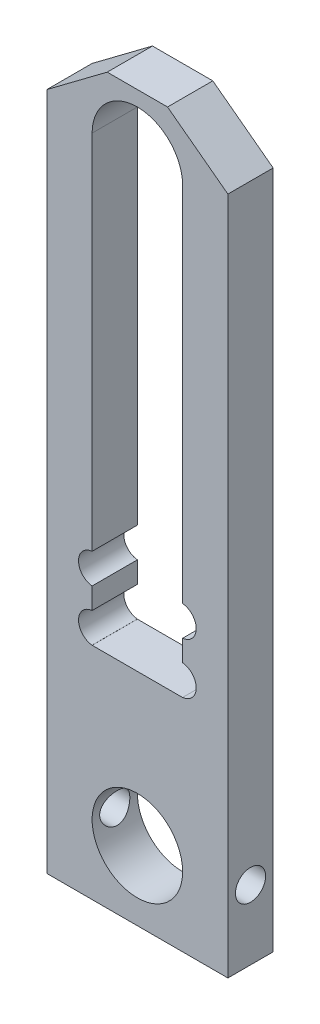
ISO-10303-21;
HEADER;
FILE_DESCRIPTION(('STEP AP214'),'2;1');
FILE_NAME('part.step','',(''),(''),'','','');
FILE_SCHEMA(('AUTOMOTIVE_DESIGN { 1 0 10303 214 1 1 1 1 }'));
ENDSEC;
DATA;
#1=APPLICATION_CONTEXT('core data for automotive mechanical design processes');
#2=APPLICATION_PROTOCOL_DEFINITION('international standard','automotive_design',2000,#1);
#3=PRODUCT_CONTEXT('',#1,'mechanical');
#4=PRODUCT('Part','Part','',(#3));
#5=PRODUCT_RELATED_PRODUCT_CATEGORY('part','',(#4));
#6=PRODUCT_DEFINITION_FORMATION('','',#4);
#7=PRODUCT_DEFINITION_CONTEXT('part definition',#1,'design');
#8=PRODUCT_DEFINITION('design','',#6,#7);
#9=PRODUCT_DEFINITION_SHAPE('','',#8);
#10=(LENGTH_UNIT() NAMED_UNIT(*) SI_UNIT(.MILLI.,.METRE.));
#11=(NAMED_UNIT(*) PLANE_ANGLE_UNIT() SI_UNIT($,.RADIAN.));
#12=(NAMED_UNIT(*) SI_UNIT($,.STERADIAN.) SOLID_ANGLE_UNIT());
#13=UNCERTAINTY_MEASURE_WITH_UNIT(LENGTH_MEASURE(1.E-05),#10,'distance_accuracy_value','');
#14=(GEOMETRIC_REPRESENTATION_CONTEXT(3) GLOBAL_UNCERTAINTY_ASSIGNED_CONTEXT((#13)) GLOBAL_UNIT_ASSIGNED_CONTEXT((#10,
#11,#12)) REPRESENTATION_CONTEXT('',''));
#15=CARTESIAN_POINT('',(0.,0.,0.));
#16=DIRECTION('',(0.,0.,1.));
#17=DIRECTION('',(1.,0.,0.));
#18=AXIS2_PLACEMENT_3D('',#15,#16,#17);
#19=CARTESIAN_POINT('',(30.,-23.,7.5));
#20=DIRECTION('',(0.,0.,1.));
#21=DIRECTION('',(1.,0.,0.));
#22=AXIS2_PLACEMENT_3D('',#19,#20,#21);
#23=PLANE('',#22);
#24=CARTESIAN_POINT('',(0.,0.,7.5));
#25=DIRECTION('',(0.,0.,1.));
#26=DIRECTION('',(1.,0.,0.));
#27=AXIS2_PLACEMENT_3D('',#24,#25,#26);
#28=CIRCLE('',#27,15.);
#29=CARTESIAN_POINT('',(15.,0.,7.5));
#30=VERTEX_POINT('',#29);
#31=EDGE_CURVE('E213',#30,#30,#28,.T.);
#32=ORIENTED_EDGE('',*,*,#31,.F.);
#33=EDGE_LOOP('',(#32));
#34=FACE_BOUND('',#33,.T.);
#35=DIRECTION('',(0.,1.,0.));
#36=VECTOR('',#35,1.);
#37=CARTESIAN_POINT('',(30.,202.,7.5));
#38=LINE('',#37,#36);
#39=CARTESIAN_POINT('',(30.,-23.,7.5));
#40=VERTEX_POINT('',#39);
#41=CARTESIAN_POINT('',(30.,202.,7.5));
#42=VERTEX_POINT('',#41);
#43=EDGE_CURVE('E216',#40,#42,#38,.T.);
#44=ORIENTED_EDGE('',*,*,#43,.T.);
#45=DIRECTION('',(-0.800000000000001,0.599999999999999,0.));
#46=VECTOR('',#45,1.);
#47=CARTESIAN_POINT('',(10.,217.,7.5));
#48=LINE('',#47,#46);
#49=CARTESIAN_POINT('',(10.,217.,7.5));
#50=VERTEX_POINT('',#49);
#51=EDGE_CURVE('E219',#42,#50,#48,.T.);
#52=ORIENTED_EDGE('',*,*,#51,.T.);
#53=DIRECTION('',(-1.,0.,0.));
#54=VECTOR('',#53,1.);
#55=CARTESIAN_POINT('',(10.,217.,7.5));
#56=LINE('',#55,#54);
#57=CARTESIAN_POINT('',(-10.,217.,7.5));
#58=VERTEX_POINT('',#57);
#59=EDGE_CURVE('E221',#50,#58,#56,.T.);
#60=ORIENTED_EDGE('',*,*,#59,.T.);
#61=DIRECTION('',(-0.800000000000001,-0.599999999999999,0.));
#62=VECTOR('',#61,1.);
#63=CARTESIAN_POINT('',(-10.,217.,7.5));
#64=LINE('',#63,#62);
#65=CARTESIAN_POINT('',(-30.,202.,7.5));
#66=VERTEX_POINT('',#65);
#67=EDGE_CURVE('E223',#58,#66,#64,.T.);
#68=ORIENTED_EDGE('',*,*,#67,.T.);
#69=DIRECTION('',(0.,-1.,0.));
#70=VECTOR('',#69,1.);
#71=CARTESIAN_POINT('',(-30.,202.,7.5));
#72=LINE('',#71,#70);
#73=CARTESIAN_POINT('',(-30.,-23.,7.5));
#74=VERTEX_POINT('',#73);
#75=EDGE_CURVE('E225',#66,#74,#72,.T.);
#76=ORIENTED_EDGE('',*,*,#75,.T.);
#77=DIRECTION('',(1.,0.,0.));
#78=VECTOR('',#77,1.);
#79=CARTESIAN_POINT('',(-30.,-23.,7.5));
#80=LINE('',#79,#78);
#81=EDGE_CURVE('E227',#74,#40,#80,.T.);
#82=ORIENTED_EDGE('',*,*,#81,.T.);
#83=EDGE_LOOP('',(#44,#52,#60,#68,#76,#82));
#84=FACE_BOUND('',#83,.T.);
#85=DIRECTION('',(0.,1.,0.));
#86=VECTOR('',#85,1.);
#87=CARTESIAN_POINT('',(15.,50.,7.5));
#88=LINE('',#87,#86);
#89=CARTESIAN_POINT('',(15.,59.9749371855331,7.5));
#90=VERTEX_POINT('',#89);
#91=CARTESIAN_POINT('',(15.,67.0250628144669,7.5));
#92=VERTEX_POINT('',#91);
#93=EDGE_CURVE('E180',#90,#92,#88,.T.);
#94=ORIENTED_EDGE('',*,*,#93,.F.);
#95=CARTESIAN_POINT('',(14.5,55.,7.5));
#96=DIRECTION('',(0.,0.,-1.));
#97=DIRECTION('',(-1.,0.,0.));
#98=AXIS2_PLACEMENT_3D('',#95,#96,#97);
#99=CIRCLE('',#98,5.);
#100=CARTESIAN_POINT('',(15.,50.0250628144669,7.5));
#101=VERTEX_POINT('',#100);
#102=EDGE_CURVE('E166',#90,#101,#99,.T.);
#103=ORIENTED_EDGE('',*,*,#102,.T.);
#104=CARTESIAN_POINT('',(15.,50.,7.5));
#105=VERTEX_POINT('',#104);
#106=EDGE_CURVE('E187',#105,#101,#88,.T.);
#107=ORIENTED_EDGE('',*,*,#106,.F.);
#108=DIRECTION('',(1.,0.,0.));
#109=VECTOR('',#108,1.);
#110=CARTESIAN_POINT('',(-15.,50.,7.5));
#111=LINE('',#110,#109);
#112=CARTESIAN_POINT('',(-15.,50.,7.5));
#113=VERTEX_POINT('',#112);
#114=EDGE_CURVE('E191',#113,#105,#111,.T.);
#115=ORIENTED_EDGE('',*,*,#114,.F.);
#116=DIRECTION('',(0.,-1.,0.));
#117=VECTOR('',#116,1.);
#118=CARTESIAN_POINT('',(-15.,50.,7.5));
#119=LINE('',#118,#117);
#120=CARTESIAN_POINT('',(-15.,50.0250628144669,7.5));
#121=VERTEX_POINT('',#120);
#122=EDGE_CURVE('E197',#121,#113,#119,.T.);
#123=ORIENTED_EDGE('',*,*,#122,.F.);
#124=CARTESIAN_POINT('',(-14.5,55.,7.5));
#125=DIRECTION('',(0.,0.,1.));
#126=DIRECTION('',(1.,0.,0.));
#127=AXIS2_PLACEMENT_3D('',#124,#125,#126);
#128=CIRCLE('',#127,5.);
#129=CARTESIAN_POINT('',(-15.,59.9749371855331,7.5));
#130=VERTEX_POINT('',#129);
#131=EDGE_CURVE('E388',#130,#121,#128,.T.);
#132=ORIENTED_EDGE('',*,*,#131,.F.);
#133=CARTESIAN_POINT('',(-15.,67.0250628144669,7.5));
#134=VERTEX_POINT('',#133);
#135=EDGE_CURVE('E202',#134,#130,#119,.T.);
#136=ORIENTED_EDGE('',*,*,#135,.F.);
#137=CARTESIAN_POINT('',(-14.5,72.,7.5));
#138=DIRECTION('',(0.,0.,1.));
#139=DIRECTION('',(1.,0.,0.));
#140=AXIS2_PLACEMENT_3D('',#137,#138,#139);
#141=CIRCLE('',#140,5.);
#142=CARTESIAN_POINT('',(-15.,76.9749371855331,7.5));
#143=VERTEX_POINT('',#142);
#144=EDGE_CURVE('E379',#143,#134,#141,.T.);
#145=ORIENTED_EDGE('',*,*,#144,.F.);
#146=CARTESIAN_POINT('',(-15.,197.,7.5));
#147=VERTEX_POINT('',#146);
#148=EDGE_CURVE('E198',#147,#143,#119,.T.);
#149=ORIENTED_EDGE('',*,*,#148,.F.);
#150=CARTESIAN_POINT('',(0.,197.,7.5));
#151=DIRECTION('',(0.,0.,1.));
#152=DIRECTION('',(1.,0.,0.));
#153=AXIS2_PLACEMENT_3D('',#150,#151,#152);
#154=CIRCLE('',#153,15.);
#155=CARTESIAN_POINT('',(15.,197.,7.5));
#156=VERTEX_POINT('',#155);
#157=EDGE_CURVE('E190',#156,#147,#154,.T.);
#158=ORIENTED_EDGE('',*,*,#157,.F.);
#159=CARTESIAN_POINT('',(15.,76.9749371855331,7.5));
#160=VERTEX_POINT('',#159);
#161=EDGE_CURVE('E188',#160,#156,#88,.T.);
#162=ORIENTED_EDGE('',*,*,#161,.F.);
#163=CARTESIAN_POINT('',(14.5,72.,7.5));
#164=DIRECTION('',(0.,0.,-1.));
#165=DIRECTION('',(-1.,0.,0.));
#166=AXIS2_PLACEMENT_3D('',#163,#164,#165);
#167=CIRCLE('',#166,5.);
#168=EDGE_CURVE('E186',#160,#92,#167,.T.);
#169=ORIENTED_EDGE('',*,*,#168,.T.);
#170=EDGE_LOOP('',(#94,#103,#107,#115,#123,#132,#136,#145,#149,#158,#162,#169));
#171=FACE_BOUND('',#170,.T.);
#172=ADVANCED_FACE('F37',(#34,#84,#171),#23,.T.);
#173=CARTESIAN_POINT('',(15.,50.,7.5));
#174=DIRECTION('',(-1.,0.,0.));
#175=DIRECTION('',(0.,0.,1.));
#176=AXIS2_PLACEMENT_3D('',#173,#174,#175);
#177=PLANE('',#176);
#178=ORIENTED_EDGE('',*,*,#106,.T.);
#179=DIRECTION('',(0.,0.,1.));
#180=VECTOR('',#179,1.);
#181=CARTESIAN_POINT('',(15.,50.0250628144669,-7.5));
#182=LINE('',#181,#180);
#183=CARTESIAN_POINT('',(15.,50.0250628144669,-7.5));
#184=VERTEX_POINT('',#183);
#185=EDGE_CURVE('E169',#101,#184,#182,.F.);
#186=ORIENTED_EDGE('',*,*,#185,.T.);
#187=DIRECTION('',(0.,1.,0.));
#188=VECTOR('',#187,1.);
#189=CARTESIAN_POINT('',(15.,50.,-7.5));
#190=LINE('',#189,#188);
#191=CARTESIAN_POINT('',(15.,50.,-7.5));
#192=VERTEX_POINT('',#191);
#193=EDGE_CURVE('E361',#192,#184,#190,.T.);
#194=ORIENTED_EDGE('',*,*,#193,.F.);
#195=DIRECTION('',(0.,0.,-1.));
#196=VECTOR('',#195,1.);
#197=CARTESIAN_POINT('',(15.,50.,7.5));
#198=LINE('',#197,#196);
#199=EDGE_CURVE('E210',#105,#192,#198,.T.);
#200=ORIENTED_EDGE('',*,*,#199,.F.);
#201=EDGE_LOOP('',(#178,#186,#194,#200));
#202=FACE_BOUND('',#201,.T.);
#203=ADVANCED_FACE('F282',(#202),#177,.T.);
#204=CARTESIAN_POINT('',(15.,59.9749371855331,-7.5));
#205=VERTEX_POINT('',#204);
#206=CARTESIAN_POINT('',(15.,67.0250628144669,-7.5));
#207=VERTEX_POINT('',#206);
#208=EDGE_CURVE('E182',#205,#207,#190,.T.);
#209=ORIENTED_EDGE('',*,*,#208,.F.);
#210=DIRECTION('',(0.,0.,1.));
#211=VECTOR('',#210,1.);
#212=CARTESIAN_POINT('',(15.,59.9749371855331,-7.5));
#213=LINE('',#212,#211);
#214=EDGE_CURVE('E58',#205,#90,#213,.T.);
#215=ORIENTED_EDGE('',*,*,#214,.T.);
#216=ORIENTED_EDGE('',*,*,#93,.T.);
#217=DIRECTION('',(0.,0.,1.));
#218=VECTOR('',#217,1.);
#219=CARTESIAN_POINT('',(15.,67.0250628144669,-7.5));
#220=LINE('',#219,#218);
#221=EDGE_CURVE('E390',#92,#207,#220,.F.);
#222=ORIENTED_EDGE('',*,*,#221,.T.);
#223=EDGE_LOOP('',(#209,#215,#216,#222));
#224=FACE_BOUND('',#223,.T.);
#225=ADVANCED_FACE('F178',(#224),#177,.T.);
#226=CARTESIAN_POINT('',(30.,-23.,-7.5));
#227=DIRECTION('',(0.,0.,1.));
#228=DIRECTION('',(1.,0.,0.));
#229=AXIS2_PLACEMENT_3D('',#226,#227,#228);
#230=PLANE('',#229);
#231=CARTESIAN_POINT('',(0.,0.,-7.5));
#232=DIRECTION('',(0.,0.,1.));
#233=DIRECTION('',(1.,0.,0.));
#234=AXIS2_PLACEMENT_3D('',#231,#232,#233);
#235=CIRCLE('',#234,15.);
#236=CARTESIAN_POINT('',(15.,0.,-7.5));
#237=VERTEX_POINT('',#236);
#238=EDGE_CURVE('E340',#237,#237,#235,.T.);
#239=ORIENTED_EDGE('',*,*,#238,.T.);
#240=EDGE_LOOP('',(#239));
#241=FACE_BOUND('',#240,.T.);
#242=DIRECTION('',(0.,1.,0.));
#243=VECTOR('',#242,1.);
#244=CARTESIAN_POINT('',(30.,202.,-7.5));
#245=LINE('',#244,#243);
#246=CARTESIAN_POINT('',(30.,-23.,-7.5));
#247=VERTEX_POINT('',#246);
#248=CARTESIAN_POINT('',(30.,202.,-7.5));
#249=VERTEX_POINT('',#248);
#250=EDGE_CURVE('E333',#247,#249,#245,.T.);
#251=ORIENTED_EDGE('',*,*,#250,.F.);
#252=DIRECTION('',(1.,0.,0.));
#253=VECTOR('',#252,1.);
#254=CARTESIAN_POINT('',(-30.,-23.,-7.5));
#255=LINE('',#254,#253);
#256=CARTESIAN_POINT('',(-30.,-23.,-7.5));
#257=VERTEX_POINT('',#256);
#258=EDGE_CURVE('E353',#257,#247,#255,.T.);
#259=ORIENTED_EDGE('',*,*,#258,.F.);
#260=DIRECTION('',(0.,-1.,0.));
#261=VECTOR('',#260,1.);
#262=CARTESIAN_POINT('',(-30.,202.,-7.5));
#263=LINE('',#262,#261);
#264=CARTESIAN_POINT('',(-30.,202.,-7.5));
#265=VERTEX_POINT('',#264);
#266=EDGE_CURVE('E351',#265,#257,#263,.T.);
#267=ORIENTED_EDGE('',*,*,#266,.F.);
#268=DIRECTION('',(-0.800000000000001,-0.599999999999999,0.));
#269=VECTOR('',#268,1.);
#270=CARTESIAN_POINT('',(-10.,217.,-7.5));
#271=LINE('',#270,#269);
#272=CARTESIAN_POINT('',(-10.,217.,-7.5));
#273=VERTEX_POINT('',#272);
#274=EDGE_CURVE('E348',#273,#265,#271,.T.);
#275=ORIENTED_EDGE('',*,*,#274,.F.);
#276=DIRECTION('',(-1.,0.,0.));
#277=VECTOR('',#276,1.);
#278=CARTESIAN_POINT('',(10.,217.,-7.5));
#279=LINE('',#278,#277);
#280=CARTESIAN_POINT('',(10.,217.,-7.5));
#281=VERTEX_POINT('',#280);
#282=EDGE_CURVE('E337',#281,#273,#279,.T.);
#283=ORIENTED_EDGE('',*,*,#282,.F.);
#284=DIRECTION('',(-0.800000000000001,0.599999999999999,0.));
#285=VECTOR('',#284,1.);
#286=CARTESIAN_POINT('',(10.,217.,-7.5));
#287=LINE('',#286,#285);
#288=EDGE_CURVE('E324',#249,#281,#287,.T.);
#289=ORIENTED_EDGE('',*,*,#288,.F.);
#290=EDGE_LOOP('',(#251,#259,#267,#275,#283,#289));
#291=FACE_BOUND('',#290,.T.);
#292=CARTESIAN_POINT('',(14.5,55.,-7.5));
#293=DIRECTION('',(0.,0.,-1.));
#294=DIRECTION('',(-1.,0.,0.));
#295=AXIS2_PLACEMENT_3D('',#292,#293,#294);
#296=CIRCLE('',#295,5.);
#297=EDGE_CURVE('E174',#205,#184,#296,.T.);
#298=ORIENTED_EDGE('',*,*,#297,.F.);
#299=ORIENTED_EDGE('',*,*,#208,.T.);
#300=CARTESIAN_POINT('',(14.5,72.,-7.5));
#301=DIRECTION('',(0.,0.,-1.));
#302=DIRECTION('',(-1.,0.,0.));
#303=AXIS2_PLACEMENT_3D('',#300,#301,#302);
#304=CIRCLE('',#303,5.);
#305=CARTESIAN_POINT('',(15.,76.9749371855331,-7.5));
#306=VERTEX_POINT('',#305);
#307=EDGE_CURVE('E393',#306,#207,#304,.T.);
#308=ORIENTED_EDGE('',*,*,#307,.F.);
#309=CARTESIAN_POINT('',(15.,197.,-7.5));
#310=VERTEX_POINT('',#309);
#311=EDGE_CURVE('E364',#306,#310,#190,.T.);
#312=ORIENTED_EDGE('',*,*,#311,.T.);
#313=CARTESIAN_POINT('',(0.,197.,-7.5));
#314=DIRECTION('',(0.,0.,1.));
#315=DIRECTION('',(1.,0.,0.));
#316=AXIS2_PLACEMENT_3D('',#313,#314,#315);
#317=CIRCLE('',#316,15.);
#318=CARTESIAN_POINT('',(-15.,197.,-7.5));
#319=VERTEX_POINT('',#318);
#320=EDGE_CURVE('E362',#310,#319,#317,.T.);
#321=ORIENTED_EDGE('',*,*,#320,.T.);
#322=DIRECTION('',(0.,-1.,0.));
#323=VECTOR('',#322,1.);
#324=CARTESIAN_POINT('',(-15.,50.,-7.5));
#325=LINE('',#324,#323);
#326=CARTESIAN_POINT('',(-15.,76.9749371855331,-7.5));
#327=VERTEX_POINT('',#326);
#328=EDGE_CURVE('E343',#319,#327,#325,.T.);
#329=ORIENTED_EDGE('',*,*,#328,.T.);
#330=CARTESIAN_POINT('',(-14.5,72.,-7.5));
#331=DIRECTION('',(0.,0.,1.));
#332=DIRECTION('',(1.,0.,0.));
#333=AXIS2_PLACEMENT_3D('',#330,#331,#332);
#334=CIRCLE('',#333,5.);
#335=CARTESIAN_POINT('',(-15.,67.0250628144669,-7.5));
#336=VERTEX_POINT('',#335);
#337=EDGE_CURVE('E376',#327,#336,#334,.T.);
#338=ORIENTED_EDGE('',*,*,#337,.T.);
#339=CARTESIAN_POINT('',(-15.,59.9749371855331,-7.5));
#340=VERTEX_POINT('',#339);
#341=EDGE_CURVE('E561',#336,#340,#325,.T.);
#342=ORIENTED_EDGE('',*,*,#341,.T.);
#343=CARTESIAN_POINT('',(-14.5,55.,-7.5));
#344=DIRECTION('',(0.,0.,1.));
#345=DIRECTION('',(1.,0.,0.));
#346=AXIS2_PLACEMENT_3D('',#343,#344,#345);
#347=CIRCLE('',#346,5.);
#348=CARTESIAN_POINT('',(-15.,50.0250628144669,-7.5));
#349=VERTEX_POINT('',#348);
#350=EDGE_CURVE('E385',#340,#349,#347,.T.);
#351=ORIENTED_EDGE('',*,*,#350,.T.);
#352=CARTESIAN_POINT('',(-15.,50.,-7.5));
#353=VERTEX_POINT('',#352);
#354=EDGE_CURVE('E366',#349,#353,#325,.T.);
#355=ORIENTED_EDGE('',*,*,#354,.T.);
#356=DIRECTION('',(1.,0.,0.));
#357=VECTOR('',#356,1.);
#358=CARTESIAN_POINT('',(-15.,50.,-7.5));
#359=LINE('',#358,#357);
#360=EDGE_CURVE('E369',#353,#192,#359,.T.);
#361=ORIENTED_EDGE('',*,*,#360,.T.);
#362=ORIENTED_EDGE('',*,*,#193,.T.);
#363=EDGE_LOOP('',(#298,#299,#308,#312,#321,#329,#338,#342,#351,#355,#361,#362));
#364=FACE_BOUND('',#363,.T.);
#365=ADVANCED_FACE('F267',(#241,#291,#364),#230,.F.);
#366=ORIENTED_EDGE('',*,*,#311,.F.);
#367=DIRECTION('',(0.,0.,1.));
#368=VECTOR('',#367,1.);
#369=CARTESIAN_POINT('',(15.,76.9749371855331,-7.5));
#370=LINE('',#369,#368);
#371=EDGE_CURVE('E66',#306,#160,#370,.T.);
#372=ORIENTED_EDGE('',*,*,#371,.T.);
#373=ORIENTED_EDGE('',*,*,#161,.T.);
#374=DIRECTION('',(0.,0.,-1.));
#375=VECTOR('',#374,1.);
#376=CARTESIAN_POINT('',(15.,197.,7.5));
#377=LINE('',#376,#375);
#378=EDGE_CURVE('E207',#156,#310,#377,.T.);
#379=ORIENTED_EDGE('',*,*,#378,.T.);
#380=EDGE_LOOP('',(#366,#372,#373,#379));
#381=FACE_BOUND('',#380,.T.);
#382=ADVANCED_FACE('F270',(#381),#177,.T.);
#383=CARTESIAN_POINT('',(-15.,50.,7.5));
#384=DIRECTION('',(1.,0.,0.));
#385=DIRECTION('',(0.,0.,-1.));
#386=AXIS2_PLACEMENT_3D('',#383,#384,#385);
#387=PLANE('',#386);
#388=DIRECTION('',(0.,0.,1.));
#389=VECTOR('',#388,1.);
#390=CARTESIAN_POINT('',(-15.,59.9749371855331,-7.5));
#391=LINE('',#390,#389);
#392=EDGE_CURVE('E381',#340,#130,#391,.T.);
#393=ORIENTED_EDGE('',*,*,#392,.F.);
#394=ORIENTED_EDGE('',*,*,#341,.F.);
#395=DIRECTION('',(0.,0.,1.));
#396=VECTOR('',#395,1.);
#397=CARTESIAN_POINT('',(-15.,67.0250628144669,-7.5));
#398=LINE('',#397,#396);
#399=EDGE_CURVE('E372',#134,#336,#398,.F.);
#400=ORIENTED_EDGE('',*,*,#399,.F.);
#401=ORIENTED_EDGE('',*,*,#135,.T.);
#402=EDGE_LOOP('',(#393,#394,#400,#401));
#403=FACE_BOUND('',#402,.T.);
#404=ADVANCED_FACE('F276',(#403),#387,.T.);
#405=DIRECTION('',(0.,0.,1.));
#406=VECTOR('',#405,1.);
#407=CARTESIAN_POINT('',(-15.,76.9749371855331,-7.5));
#408=LINE('',#407,#406);
#409=EDGE_CURVE('E371',#327,#143,#408,.T.);
#410=ORIENTED_EDGE('',*,*,#409,.F.);
#411=ORIENTED_EDGE('',*,*,#328,.F.);
#412=DIRECTION('',(0.,0.,-1.));
#413=VECTOR('',#412,1.);
#414=CARTESIAN_POINT('',(-15.,197.,7.5));
#415=LINE('',#414,#413);
#416=EDGE_CURVE('E205',#147,#319,#415,.T.);
#417=ORIENTED_EDGE('',*,*,#416,.F.);
#418=ORIENTED_EDGE('',*,*,#148,.T.);
#419=EDGE_LOOP('',(#410,#411,#417,#418));
#420=FACE_BOUND('',#419,.T.);
#421=ADVANCED_FACE('F277',(#420),#387,.T.);
#422=CARTESIAN_POINT('',(30.,202.,7.5));
#423=DIRECTION('',(-1.,0.,0.));
#424=DIRECTION('',(0.,-1.,0.));
#425=AXIS2_PLACEMENT_3D('',#422,#423,#424);
#426=PLANE('',#425);
#427=CARTESIAN_POINT('',(30.,0.,0.));
#428=DIRECTION('',(1.,0.,0.));
#429=DIRECTION('',(0.,1.,0.));
#430=AXIS2_PLACEMENT_3D('',#427,#428,#429);
#431=CIRCLE('',#430,5.);
#432=CARTESIAN_POINT('',(30.,4.99999999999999,0.));
#433=VERTEX_POINT('',#432);
#434=EDGE_CURVE('E400',#433,#433,#431,.T.);
#435=ORIENTED_EDGE('',*,*,#434,.F.);
#436=EDGE_LOOP('',(#435));
#437=FACE_BOUND('',#436,.T.);
#438=DIRECTION('',(0.,0.,-1.));
#439=VECTOR('',#438,1.);
#440=CARTESIAN_POINT('',(30.,-23.,7.5));
#441=LINE('',#440,#439);
#442=EDGE_CURVE('E229',#40,#247,#441,.T.);
#443=ORIENTED_EDGE('',*,*,#442,.T.);
#444=ORIENTED_EDGE('',*,*,#250,.T.);
#445=DIRECTION('',(0.,0.,-1.));
#446=VECTOR('',#445,1.);
#447=CARTESIAN_POINT('',(30.,202.,7.5));
#448=LINE('',#447,#446);
#449=EDGE_CURVE('E11',#42,#249,#448,.T.);
#450=ORIENTED_EDGE('',*,*,#449,.F.);
#451=ORIENTED_EDGE('',*,*,#43,.F.);
#452=EDGE_LOOP('',(#443,#444,#450,#451));
#453=FACE_BOUND('',#452,.T.);
#454=ADVANCED_FACE('F39',(#437,#453),#426,.F.);
#455=CARTESIAN_POINT('',(10.,217.,7.5));
#456=DIRECTION('',(-0.599999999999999,-0.800000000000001,0.));
#457=DIRECTION('',(0.800000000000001,-0.599999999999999,0.));
#458=AXIS2_PLACEMENT_3D('',#455,#456,#457);
#459=PLANE('',#458);
#460=ORIENTED_EDGE('',*,*,#449,.T.);
#461=ORIENTED_EDGE('',*,*,#288,.T.);
#462=DIRECTION('',(0.,0.,-1.));
#463=VECTOR('',#462,1.);
#464=CARTESIAN_POINT('',(10.,217.,7.5));
#465=LINE('',#464,#463);
#466=EDGE_CURVE('E50',#50,#281,#465,.T.);
#467=ORIENTED_EDGE('',*,*,#466,.F.);
#468=ORIENTED_EDGE('',*,*,#51,.F.);
#469=EDGE_LOOP('',(#460,#461,#467,#468));
#470=FACE_BOUND('',#469,.T.);
#471=ADVANCED_FACE('F312',(#470),#459,.F.);
#472=CARTESIAN_POINT('',(10.,217.,7.5));
#473=DIRECTION('',(0.,-1.,0.));
#474=DIRECTION('',(0.,0.,-1.));
#475=AXIS2_PLACEMENT_3D('',#472,#473,#474);
#476=PLANE('',#475);
#477=ORIENTED_EDGE('',*,*,#466,.T.);
#478=ORIENTED_EDGE('',*,*,#282,.T.);
#479=DIRECTION('',(0.,0.,-1.));
#480=VECTOR('',#479,1.);
#481=CARTESIAN_POINT('',(-10.,217.,7.5));
#482=LINE('',#481,#480);
#483=EDGE_CURVE('E235',#58,#273,#482,.T.);
#484=ORIENTED_EDGE('',*,*,#483,.F.);
#485=ORIENTED_EDGE('',*,*,#59,.F.);
#486=EDGE_LOOP('',(#477,#478,#484,#485));
#487=FACE_BOUND('',#486,.T.);
#488=ADVANCED_FACE('F309',(#487),#476,.F.);
#489=CARTESIAN_POINT('',(-10.,217.,7.5));
#490=DIRECTION('',(0.599999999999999,-0.800000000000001,0.));
#491=DIRECTION('',(0.800000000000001,0.599999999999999,0.));
#492=AXIS2_PLACEMENT_3D('',#489,#490,#491);
#493=PLANE('',#492);
#494=ORIENTED_EDGE('',*,*,#483,.T.);
#495=ORIENTED_EDGE('',*,*,#274,.T.);
#496=DIRECTION('',(0.,0.,-1.));
#497=VECTOR('',#496,1.);
#498=CARTESIAN_POINT('',(-30.,202.,7.5));
#499=LINE('',#498,#497);
#500=EDGE_CURVE('E233',#66,#265,#499,.T.);
#501=ORIENTED_EDGE('',*,*,#500,.F.);
#502=ORIENTED_EDGE('',*,*,#67,.F.);
#503=EDGE_LOOP('',(#494,#495,#501,#502));
#504=FACE_BOUND('',#503,.T.);
#505=ADVANCED_FACE('F305',(#504),#493,.F.);
#506=CARTESIAN_POINT('',(-30.,202.,7.5));
#507=DIRECTION('',(1.,0.,0.));
#508=DIRECTION('',(0.,1.,0.));
#509=AXIS2_PLACEMENT_3D('',#506,#507,#508);
#510=PLANE('',#509);
#511=CARTESIAN_POINT('',(-30.0000000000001,0.,0.));
#512=DIRECTION('',(1.,0.,0.));
#513=DIRECTION('',(0.,1.,0.));
#514=AXIS2_PLACEMENT_3D('',#511,#512,#513);
#515=CIRCLE('',#514,5.);
#516=CARTESIAN_POINT('',(-30.0000000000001,5.00000000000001,0.));
#517=VERTEX_POINT('',#516);
#518=EDGE_CURVE('E241',#517,#517,#515,.T.);
#519=ORIENTED_EDGE('',*,*,#518,.T.);
#520=EDGE_LOOP('',(#519));
#521=FACE_BOUND('',#520,.T.);
#522=ORIENTED_EDGE('',*,*,#500,.T.);
#523=ORIENTED_EDGE('',*,*,#266,.T.);
#524=DIRECTION('',(0.,0.,-1.));
#525=VECTOR('',#524,1.);
#526=CARTESIAN_POINT('',(-30.,-23.,7.5));
#527=LINE('',#526,#525);
#528=EDGE_CURVE('E231',#74,#257,#527,.T.);
#529=ORIENTED_EDGE('',*,*,#528,.F.);
#530=ORIENTED_EDGE('',*,*,#75,.F.);
#531=EDGE_LOOP('',(#522,#523,#529,#530));
#532=FACE_BOUND('',#531,.T.);
#533=ADVANCED_FACE('F301',(#521,#532),#510,.F.);
#534=CARTESIAN_POINT('',(-30.,-23.,7.5));
#535=DIRECTION('',(0.,1.,0.));
#536=DIRECTION('',(0.,0.,1.));
#537=AXIS2_PLACEMENT_3D('',#534,#535,#536);
#538=PLANE('',#537);
#539=ORIENTED_EDGE('',*,*,#528,.T.);
#540=ORIENTED_EDGE('',*,*,#258,.T.);
#541=ORIENTED_EDGE('',*,*,#442,.F.);
#542=ORIENTED_EDGE('',*,*,#81,.F.);
#543=EDGE_LOOP('',(#539,#540,#541,#542));
#544=FACE_BOUND('',#543,.T.);
#545=ADVANCED_FACE('F290',(#544),#538,.F.);
#546=CARTESIAN_POINT('',(0.,0.,7.5));
#547=DIRECTION('',(0.,0.,-1.));
#548=DIRECTION('',(-1.,0.,0.));
#549=AXIS2_PLACEMENT_3D('',#546,#547,#548);
#550=CYLINDRICAL_SURFACE('',#549,15.);
#551=CARTESIAN_POINT('',(-15.,0.,5.));
#552=CARTESIAN_POINT('',(-15.0000007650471,-0.272816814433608,5.00000126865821));
#553=CARTESIAN_POINT('',(-14.9924884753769,-0.545625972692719,4.97759866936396));
#554=CARTESIAN_POINT('',(-14.9632605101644,-1.08320880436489,4.88885445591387));
#555=CARTESIAN_POINT('',(-14.941543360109,-1.3479816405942,4.82250828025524));
#556=CARTESIAN_POINT('',(-14.8862653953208,-1.86166394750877,4.64840378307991));
#557=CARTESIAN_POINT('',(-14.8527243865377,-2.11059912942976,4.5407146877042));
#558=CARTESIAN_POINT('',(-14.7772222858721,-2.58687468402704,4.2872941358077));
#559=CARTESIAN_POINT('',(-14.7352595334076,-2.81421078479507,4.1415551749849));
#560=CARTESIAN_POINT('',(-14.6457047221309,-3.24870837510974,3.81087097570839));
#561=CARTESIAN_POINT('',(-14.5979778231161,-3.45501850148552,3.62484382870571));
#562=CARTESIAN_POINT('',(-14.5030157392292,-3.83416346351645,3.22116422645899));
#563=CARTESIAN_POINT('',(-14.4557806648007,-4.00699092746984,3.00350482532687));
#564=CARTESIAN_POINT('',(-14.3656666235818,-4.31912471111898,2.53507442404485));
#565=CARTESIAN_POINT('',(-14.3229519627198,-4.45732429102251,2.28353130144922));
#566=CARTESIAN_POINT('',(-14.2487652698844,-4.68909436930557,1.75911952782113));
#567=CARTESIAN_POINT('',(-14.2172898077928,-4.78267848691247,1.48625741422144));
#568=CARTESIAN_POINT('',(-14.1705651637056,-4.91936730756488,0.936633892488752));
#569=CARTESIAN_POINT('',(-14.1548047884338,-4.96406724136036,0.660313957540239));
#570=CARTESIAN_POINT('',(-14.1397828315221,-5.00670561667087,0.103681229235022));
#571=CARTESIAN_POINT('',(-14.1405161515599,-5.00465850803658,-0.176630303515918));
#572=CARTESIAN_POINT('',(-14.1579507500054,-4.95509951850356,-0.71968315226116));
#573=CARTESIAN_POINT('',(-14.1739207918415,-4.90966956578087,-0.98264201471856));
#574=CARTESIAN_POINT('',(-14.2188328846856,-4.77803081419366,-1.49696709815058));
#575=CARTESIAN_POINT('',(-14.2477764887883,-4.69181713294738,-1.74833192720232));
#576=CARTESIAN_POINT('',(-14.3158955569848,-4.47969529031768,-2.2370637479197));
#577=CARTESIAN_POINT('',(-14.3552282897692,-4.35317024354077,-2.47414012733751));
#578=CARTESIAN_POINT('',(-14.4396279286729,-4.06444553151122,-2.92435454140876));
#579=CARTESIAN_POINT('',(-14.4846964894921,-3.9022355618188,-3.13748563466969));
#580=CARTESIAN_POINT('',(-14.5783664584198,-3.53674666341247,-3.54545799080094));
#581=CARTESIAN_POINT('',(-14.6270294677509,-3.3317657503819,-3.73876347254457));
#582=CARTESIAN_POINT('',(-14.7203469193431,-2.89169784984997,-4.08865633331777));
#583=CARTESIAN_POINT('',(-14.765000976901,-2.65660797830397,-4.24524019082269));
#584=CARTESIAN_POINT('',(-14.8458553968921,-2.15973806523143,-4.51848150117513));
#585=CARTESIAN_POINT('',(-14.8819675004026,-1.8977163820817,-4.6347274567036));
#586=CARTESIAN_POINT('',(-14.9410283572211,-1.35634541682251,-4.82101586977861));
#587=CARTESIAN_POINT('',(-14.9639816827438,-1.07700219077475,-4.8910743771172));
#588=CARTESIAN_POINT('',(-14.9933813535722,-0.521919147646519,-4.98027833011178));
#589=CARTESIAN_POINT('',(-15.0005000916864,-0.246547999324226,-5.00149904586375));
#590=CARTESIAN_POINT('',(-14.9994451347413,0.303875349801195,-4.99833663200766));
#591=CARTESIAN_POINT('',(-14.9912740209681,0.578927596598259,-4.97396120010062));
#592=CARTESIAN_POINT('',(-14.9610012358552,1.11259933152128,-4.8819404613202));
#593=CARTESIAN_POINT('',(-14.9393099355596,1.37146403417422,-4.81556896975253));
#594=CARTESIAN_POINT('',(-14.8845923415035,1.87427979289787,-4.64303277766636));
#595=CARTESIAN_POINT('',(-14.8515646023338,2.11822894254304,-4.53686300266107));
#596=CARTESIAN_POINT('',(-14.7764465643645,2.59144148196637,-4.28464784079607));
#597=CARTESIAN_POINT('',(-14.7341407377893,2.82014979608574,-4.13762703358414));
#598=CARTESIAN_POINT('',(-14.6452626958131,3.25032415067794,-3.80902924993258));
#599=CARTESIAN_POINT('',(-14.5986891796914,3.45178183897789,-3.62744171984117));
#600=CARTESIAN_POINT('',(-14.5038423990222,3.8312625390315,-3.22510624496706));
#601=CARTESIAN_POINT('',(-14.4555880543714,4.00780484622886,-3.00295386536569));
#602=CARTESIAN_POINT('',(-14.3649986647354,4.32128761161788,-2.53114216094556));
#603=CARTESIAN_POINT('',(-14.3226636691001,4.45822773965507,-2.28148260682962));
#604=CARTESIAN_POINT('',(-14.2491195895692,4.68798465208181,-1.76163492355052));
#605=CARTESIAN_POINT('',(-14.2178880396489,4.78089066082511,-1.49148960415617));
#606=CARTESIAN_POINT('',(-14.1705416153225,4.91947333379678,-0.938106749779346));
#607=CARTESIAN_POINT('',(-14.154419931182,4.9651712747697,-0.65487517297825));
#608=CARTESIAN_POINT('',(-14.1398929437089,5.00638141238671,-0.0990145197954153));
#609=CARTESIAN_POINT('',(-14.1406200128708,5.004351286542,0.17341170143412));
#610=CARTESIAN_POINT('',(-14.1575634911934,4.95621146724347,0.713825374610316));
#611=CARTESIAN_POINT('',(-14.1737789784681,4.91010439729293,0.981813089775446));
#612=CARTESIAN_POINT('',(-14.2192262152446,4.77685906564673,1.50067831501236));
#613=CARTESIAN_POINT('',(-14.2482049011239,4.69051673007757,1.75178412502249));
#614=CARTESIAN_POINT('',(-14.3158199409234,4.47989682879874,2.23613703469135));
#615=CARTESIAN_POINT('',(-14.3544584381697,4.35561084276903,2.46938015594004));
#616=CARTESIAN_POINT('',(-14.4391414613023,4.06630346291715,2.92241834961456));
#617=CARTESIAN_POINT('',(-14.4854355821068,3.89974121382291,3.14118250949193));
#618=CARTESIAN_POINT('',(-14.5791678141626,3.53321441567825,3.548449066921));
#619=CARTESIAN_POINT('',(-14.6266062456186,3.33324042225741,3.73694287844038));
#620=CARTESIAN_POINT('',(-14.7195015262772,2.89620778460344,4.08572206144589));
#621=CARTESIAN_POINT('',(-14.7648090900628,2.65800756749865,4.244621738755));
#622=CARTESIAN_POINT('',(-14.8462995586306,2.15678678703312,4.51995214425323));
#623=CARTESIAN_POINT('',(-14.8824847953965,1.89377259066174,4.63639372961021));
#624=CARTESIAN_POINT('',(-14.9402757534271,1.36246823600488,4.81860816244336));
#625=CARTESIAN_POINT('',(-14.9624606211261,1.09493878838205,4.88641233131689));
#626=CARTESIAN_POINT('',(-14.9923203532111,0.551602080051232,4.97710140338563));
#627=CARTESIAN_POINT('',(-14.9999992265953,0.275797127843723,4.99999871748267));
#628=CARTESIAN_POINT('',(-15.,0.,5.));
#629=B_SPLINE_CURVE_WITH_KNOTS('',3,(#551,#552,#553,#554,#555,#556,#557,#558,#559,#560,#561,
#562,#563,#564,#565,#566,#567,#568,#569,#570,#571,#572,#573,#574,#575,#576,#577,#578,#579,#580,
#581,#582,#583,#584,#585,#586,#587,#588,#589,#590,#591,#592,#593,#594,#595,#596,#597,#598,#599,
#600,#601,#602,#603,#604,#605,#606,#607,#608,#609,#610,#611,#612,#613,#614,#615,#616,#617,#618,
#619,#620,#621,#622,#623,#624,#625,#626,#627,#628),.UNSPECIFIED.,.T.,.F.,(4,2,2,2,2,2,2,2,2,2,2,
2,2,2,2,2,2,2,2,2,2,2,2,2,2,2,2,2,2,2,2,2,2,2,2,2,2,2,4),(0.,0.817435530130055,1.6349559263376,
2.45111336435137,3.2674318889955,4.1092342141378,4.95122166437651,5.81741924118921,
6.6833522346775,7.52009628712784,8.3565816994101,9.15484132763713,9.95319654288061,
10.764408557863,11.5758551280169,12.4296652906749,13.2835572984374,14.1459202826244,
15.0079834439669,15.832679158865,16.6572356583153,17.4579078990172,18.2586822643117,
19.0805199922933,19.9026090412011,20.7620511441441,21.6215004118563,22.479200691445,
23.3365142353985,24.1497833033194,24.9630039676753,25.7607793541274,26.5587319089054,
27.3915033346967,28.2245105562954,29.0899830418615,29.9552340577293,30.7818279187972,
31.6081933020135),.UNSPECIFIED.);
#630=CARTESIAN_POINT('',(-15.,0.,5.));
#631=VERTEX_POINT('',#630);
#632=EDGE_CURVE('E41',#631,#631,#629,.T.);
#633=ORIENTED_EDGE('',*,*,#632,.F.);
#634=EDGE_LOOP('',(#633));
#635=FACE_BOUND('',#634,.T.);
#636=CARTESIAN_POINT('',(14.142135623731,5.,0.));
#637=CARTESIAN_POINT('',(14.1421347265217,5.00000128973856,-0.27234087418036));
#638=CARTESIAN_POINT('',(14.1500884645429,4.97767391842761,-0.544673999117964));
#639=CARTESIAN_POINT('',(14.1808787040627,4.88925565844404,-1.08127210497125));
#640=CARTESIAN_POINT('',(14.2037176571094,4.82315756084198,-1.34553574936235));
#641=CARTESIAN_POINT('',(14.2614101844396,4.64977742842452,-1.85813446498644));
#642=CARTESIAN_POINT('',(14.2962401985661,4.54257610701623,-2.10649964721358));
#643=CARTESIAN_POINT('',(14.3739561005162,4.2903081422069,-2.58180024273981));
#644=CARTESIAN_POINT('',(14.4168437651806,4.14523314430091,-2.80873091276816));
#645=CARTESIAN_POINT('',(14.5077244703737,3.81525573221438,-3.24359981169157));
#646=CARTESIAN_POINT('',(14.5558447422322,3.62912170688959,-3.45057714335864));
#647=CARTESIAN_POINT('',(14.6506932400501,3.22493833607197,-3.8310340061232));
#648=CARTESIAN_POINT('',(14.6974212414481,3.00688387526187,-4.00450815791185));
#649=CARTESIAN_POINT('',(14.7856933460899,2.53802253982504,-4.31739448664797));
#650=CARTESIAN_POINT('',(14.8270703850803,2.28650955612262,-4.45579985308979));
#651=CARTESIAN_POINT('',(14.8984793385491,1.76215611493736,-4.68795792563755));
#652=CARTESIAN_POINT('',(14.9285143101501,1.48932142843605,-4.78172266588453));
#653=CARTESIAN_POINT('',(14.9729537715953,0.940144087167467,-4.91867927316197));
#654=CARTESIAN_POINT('',(14.987865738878,0.664253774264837,-4.96351723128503));
#655=CARTESIAN_POINT('',(15.0021804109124,0.108489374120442,-5.0065814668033));
#656=CARTESIAN_POINT('',(15.0015871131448,-0.171383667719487,-5.00481975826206));
#657=CARTESIAN_POINT('',(14.9853019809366,-0.715517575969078,-4.95577872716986));
#658=CARTESIAN_POINT('',(14.9702032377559,-0.979960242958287,-4.91028735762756));
#659=CARTESIAN_POINT('',(14.9273483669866,-1.49721719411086,-4.77803509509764));
#660=CARTESIAN_POINT('',(14.8995913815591,-1.75003068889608,-4.69127140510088));
#661=CARTESIAN_POINT('',(14.8337835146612,-2.24076237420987,-4.4778934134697));
#662=CARTESIAN_POINT('',(14.7956021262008,-2.47844110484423,-4.35077030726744));
#663=CARTESIAN_POINT('',(14.712919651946,-2.92962162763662,-4.06070147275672));
#664=CARTESIAN_POINT('',(14.6684168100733,-3.14311667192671,-3.89774578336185));
#665=CARTESIAN_POINT('',(14.5753095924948,-3.55050433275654,-3.53162803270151));
#666=CARTESIAN_POINT('',(14.5266107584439,-3.74300078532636,-3.32693421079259));
#667=CARTESIAN_POINT('',(14.432366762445,-4.09138629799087,-2.88775637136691));
#668=CARTESIAN_POINT('',(14.3868220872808,-4.24726971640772,-2.65326777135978));
#669=CARTESIAN_POINT('',(14.3035262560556,-4.51993727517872,-2.1567318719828));
#670=CARTESIAN_POINT('',(14.2658954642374,-4.6361323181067,-1.89433934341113));
#671=CARTESIAN_POINT('',(14.2040825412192,-4.82221596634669,-1.35214302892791));
#672=CARTESIAN_POINT('',(14.1798947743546,-4.89212397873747,-1.07234659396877));
#673=CARTESIAN_POINT('',(14.1489818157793,-4.98080641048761,-0.516808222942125));
#674=CARTESIAN_POINT('',(14.1415180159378,-5.00174547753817,-0.241452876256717));
#675=CARTESIAN_POINT('',(14.1428336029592,-4.9980271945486,0.308880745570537));
#676=CARTESIAN_POINT('',(14.1516100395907,-4.97337812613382,0.583859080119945));
#677=CARTESIAN_POINT('',(14.183680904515,-4.88112825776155,1.11578482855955));
#678=CARTESIAN_POINT('',(14.206466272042,-4.81503196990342,1.37302715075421));
#679=CARTESIAN_POINT('',(14.2634276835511,-4.64356931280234,1.87271803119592));
#680=CARTESIAN_POINT('',(14.297605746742,-4.53819598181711,2.1151639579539));
#681=CARTESIAN_POINT('',(14.3748438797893,-4.28737170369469,2.58690210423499));
#682=CARTESIAN_POINT('',(14.4181512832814,-4.14075559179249,2.81553321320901));
#683=CARTESIAN_POINT('',(14.5082884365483,-3.81292815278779,3.2457302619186));
#684=CARTESIAN_POINT('',(14.5551192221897,-3.63170662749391,3.4472881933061));
#685=CARTESIAN_POINT('',(14.6497519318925,-3.22945852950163,3.8276399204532));
#686=CARTESIAN_POINT('',(14.6974921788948,-3.00693635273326,4.00487195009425));
#687=CARTESIAN_POINT('',(14.7863425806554,-2.53413645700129,4.31958071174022));
#688=CARTESIAN_POINT('',(14.8274529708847,-2.28385972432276,4.45705885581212));
#689=CARTESIAN_POINT('',(14.8982202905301,-1.76389931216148,4.68710052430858));
#690=CARTESIAN_POINT('',(14.9279515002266,-1.49435561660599,4.77995638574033));
#691=CARTESIAN_POINT('',(14.9729305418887,-0.942292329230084,4.91863871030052));
#692=CARTESIAN_POINT('',(14.9881836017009,-0.659777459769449,4.96448214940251));
#693=CARTESIAN_POINT('',(15.0020931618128,-0.104076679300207,5.00631038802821));
#694=CARTESIAN_POINT('',(15.001496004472,0.168923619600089,5.00453726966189));
#695=CARTESIAN_POINT('',(14.9856098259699,0.710555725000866,4.95671345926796));
#696=CARTESIAN_POINT('',(14.9703219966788,0.979187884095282,4.91066635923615));
#697=CARTESIAN_POINT('',(14.9270457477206,1.50021059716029,4.77708882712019));
#698=CARTESIAN_POINT('',(14.8992629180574,1.75279135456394,4.69022892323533));
#699=CARTESIAN_POINT('',(14.8338580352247,2.23989175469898,4.47811234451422));
#700=CARTESIAN_POINT('',(14.7962342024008,2.47440812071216,4.35284872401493));
#701=CARTESIAN_POINT('',(14.713293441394,2.92817008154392,4.06215243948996));
#702=CARTESIAN_POINT('',(14.6677436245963,3.14653125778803,3.8954065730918));
#703=CARTESIAN_POINT('',(14.574649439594,3.55290513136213,3.52871304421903));
#704=CARTESIAN_POINT('',(14.5271044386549,3.74090810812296,3.32875478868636));
#705=CARTESIAN_POINT('',(14.4331639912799,4.08870904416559,2.89195322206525));
#706=CARTESIAN_POINT('',(14.3868863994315,4.2471148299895,2.6539724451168));
#707=CARTESIAN_POINT('',(14.3030096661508,4.52157171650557,2.1533278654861));
#708=CARTESIAN_POINT('',(14.2654082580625,4.63763388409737,1.89067053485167));
#709=CARTESIAN_POINT('',(14.2050667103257,4.81921914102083,1.36019087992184));
#710=CARTESIAN_POINT('',(14.1817316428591,4.88678954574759,1.09313868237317));
#711=CARTESIAN_POINT('',(14.1502691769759,4.97717160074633,0.550719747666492));
#712=CARTESIAN_POINT('',(14.1421365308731,4.99999869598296,0.275355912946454));
#713=CARTESIAN_POINT('',(14.142135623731,5.,0.));
#714=B_SPLINE_CURVE_WITH_KNOTS('',3,(#636,#637,#638,#639,#640,#641,#642,#643,#644,#645,#646,
#647,#648,#649,#650,#651,#652,#653,#654,#655,#656,#657,#658,#659,#660,#661,#662,#663,#664,#665,
#666,#667,#668,#669,#670,#671,#672,#673,#674,#675,#676,#677,#678,#679,#680,#681,#682,#683,#684,
#685,#686,#687,#688,#689,#690,#691,#692,#693,#694,#695,#696,#697,#698,#699,#700,#701,#702,#703,
#704,#705,#706,#707,#708,#709,#710,#711,#712,#713),.UNSPECIFIED.,.T.,.F.,(4,2,2,2,2,2,2,2,2,2,2,
2,2,2,2,2,2,2,2,2,2,2,2,2,2,2,2,2,2,2,2,2,2,2,2,2,2,2,4),(0.,0.81600292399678,1.63214027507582,
2.44668313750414,3.26140583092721,4.10506687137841,4.9488632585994,5.81467530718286,
6.68025381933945,7.51571593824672,8.35096266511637,9.15345024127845,9.95599220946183,
10.7690827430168,11.5823995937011,12.4340087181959,13.2857489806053,14.1496319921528,
15.0131525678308,15.837714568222,16.6621267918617,17.4582197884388,18.2544539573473,
19.0759428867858,19.8976742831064,20.7589404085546,21.6201759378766,22.4756895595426,
23.3308941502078,24.1459042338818,24.9608482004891,25.7628478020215,26.5649925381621,
27.3967759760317,28.2288252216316,29.0934451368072,29.9578389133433,30.7831606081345,
31.6081973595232),.UNSPECIFIED.);
#715=CARTESIAN_POINT('',(14.142135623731,5.,0.));
#716=VERTEX_POINT('',#715);
#717=EDGE_CURVE('E237',#716,#716,#714,.T.);
#718=ORIENTED_EDGE('',*,*,#717,.F.);
#719=EDGE_LOOP('',(#718));
#720=FACE_BOUND('',#719,.T.);
#721=ORIENTED_EDGE('',*,*,#31,.T.);
#722=EDGE_LOOP('',(#721));
#723=FACE_BOUND('',#722,.T.);
#724=ORIENTED_EDGE('',*,*,#238,.F.);
#725=EDGE_LOOP('',(#724));
#726=FACE_BOUND('',#725,.T.);
#727=ADVANCED_FACE('F242',(#635,#720,#723,#726),#550,.F.);
#728=CARTESIAN_POINT('',(-15.,50.,7.5));
#729=DIRECTION('',(0.,1.,0.));
#730=DIRECTION('',(0.,0.,1.));
#731=AXIS2_PLACEMENT_3D('',#728,#729,#730);
#732=PLANE('',#731);
#733=ORIENTED_EDGE('',*,*,#199,.T.);
#734=ORIENTED_EDGE('',*,*,#360,.F.);
#735=DIRECTION('',(0.,0.,-1.));
#736=VECTOR('',#735,1.);
#737=CARTESIAN_POINT('',(-15.,50.,7.5));
#738=LINE('',#737,#736);
#739=EDGE_CURVE('E201',#113,#353,#738,.T.);
#740=ORIENTED_EDGE('',*,*,#739,.F.);
#741=ORIENTED_EDGE('',*,*,#114,.T.);
#742=EDGE_LOOP('',(#733,#734,#740,#741));
#743=FACE_BOUND('',#742,.T.);
#744=ADVANCED_FACE('F280',(#743),#732,.T.);
#745=CARTESIAN_POINT('',(0.,197.,7.5));
#746=DIRECTION('',(0.,0.,-1.));
#747=DIRECTION('',(-1.,0.,0.));
#748=AXIS2_PLACEMENT_3D('',#745,#746,#747);
#749=CYLINDRICAL_SURFACE('',#748,15.);
#750=ORIENTED_EDGE('',*,*,#416,.T.);
#751=ORIENTED_EDGE('',*,*,#320,.F.);
#752=ORIENTED_EDGE('',*,*,#378,.F.);
#753=ORIENTED_EDGE('',*,*,#157,.T.);
#754=EDGE_LOOP('',(#750,#751,#752,#753));
#755=FACE_BOUND('',#754,.T.);
#756=ADVANCED_FACE('F274',(#755),#749,.F.);
#757=DIRECTION('',(0.,0.,1.));
#758=VECTOR('',#757,1.);
#759=CARTESIAN_POINT('',(-15.,50.0250628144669,-7.5));
#760=LINE('',#759,#758);
#761=EDGE_CURVE('E383',#121,#349,#760,.F.);
#762=ORIENTED_EDGE('',*,*,#761,.F.);
#763=ORIENTED_EDGE('',*,*,#122,.T.);
#764=ORIENTED_EDGE('',*,*,#739,.T.);
#765=ORIENTED_EDGE('',*,*,#354,.F.);
#766=EDGE_LOOP('',(#762,#763,#764,#765));
#767=FACE_BOUND('',#766,.T.);
#768=ADVANCED_FACE('F265',(#767),#387,.T.);
#769=CARTESIAN_POINT('',(-14.5,72.,-7.5));
#770=DIRECTION('',(0.,0.,1.));
#771=DIRECTION('',(1.,0.,0.));
#772=AXIS2_PLACEMENT_3D('',#769,#770,#771);
#773=CYLINDRICAL_SURFACE('',#772,5.);
#774=ORIENTED_EDGE('',*,*,#409,.T.);
#775=ORIENTED_EDGE('',*,*,#144,.T.);
#776=ORIENTED_EDGE('',*,*,#399,.T.);
#777=ORIENTED_EDGE('',*,*,#337,.F.);
#778=EDGE_LOOP('',(#774,#775,#776,#777));
#779=FACE_BOUND('',#778,.T.);
#780=ADVANCED_FACE('F261',(#779),#773,.F.);
#781=CARTESIAN_POINT('',(-14.5,55.,-7.5));
#782=DIRECTION('',(0.,0.,1.));
#783=DIRECTION('',(1.,0.,0.));
#784=AXIS2_PLACEMENT_3D('',#781,#782,#783);
#785=CYLINDRICAL_SURFACE('',#784,5.);
#786=ORIENTED_EDGE('',*,*,#392,.T.);
#787=ORIENTED_EDGE('',*,*,#131,.T.);
#788=ORIENTED_EDGE('',*,*,#761,.T.);
#789=ORIENTED_EDGE('',*,*,#350,.F.);
#790=EDGE_LOOP('',(#786,#787,#788,#789));
#791=FACE_BOUND('',#790,.T.);
#792=ADVANCED_FACE('F258',(#791),#785,.F.);
#793=CARTESIAN_POINT('',(14.5,72.,-7.5));
#794=DIRECTION('',(0.,0.,1.));
#795=DIRECTION('',(1.,0.,0.));
#796=AXIS2_PLACEMENT_3D('',#793,#794,#795);
#797=CYLINDRICAL_SURFACE('',#796,5.);
#798=ORIENTED_EDGE('',*,*,#168,.F.);
#799=ORIENTED_EDGE('',*,*,#371,.F.);
#800=ORIENTED_EDGE('',*,*,#307,.T.);
#801=ORIENTED_EDGE('',*,*,#221,.F.);
#802=EDGE_LOOP('',(#798,#799,#800,#801));
#803=FACE_BOUND('',#802,.T.);
#804=ADVANCED_FACE('F255',(#803),#797,.F.);
#805=CARTESIAN_POINT('',(14.5,55.,-7.5));
#806=DIRECTION('',(0.,0.,1.));
#807=DIRECTION('',(1.,0.,0.));
#808=AXIS2_PLACEMENT_3D('',#805,#806,#807);
#809=CYLINDRICAL_SURFACE('',#808,5.);
#810=ORIENTED_EDGE('',*,*,#102,.F.);
#811=ORIENTED_EDGE('',*,*,#214,.F.);
#812=ORIENTED_EDGE('',*,*,#297,.T.);
#813=ORIENTED_EDGE('',*,*,#185,.F.);
#814=EDGE_LOOP('',(#810,#811,#812,#813));
#815=FACE_BOUND('',#814,.T.);
#816=ADVANCED_FACE('F167',(#815),#809,.F.);
#817=CARTESIAN_POINT('',(-30.0000000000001,0.,0.));
#818=DIRECTION('',(1.,0.,0.));
#819=DIRECTION('',(0.,1.,0.));
#820=AXIS2_PLACEMENT_3D('',#817,#818,#819);
#821=CYLINDRICAL_SURFACE('',#820,5.);
#822=ORIENTED_EDGE('',*,*,#717,.T.);
#823=EDGE_LOOP('',(#822));
#824=FACE_BOUND('',#823,.T.);
#825=ORIENTED_EDGE('',*,*,#434,.T.);
#826=EDGE_LOOP('',(#825));
#827=FACE_BOUND('',#826,.T.);
#828=ADVANCED_FACE('F246',(#824,#827),#821,.F.);
#829=ORIENTED_EDGE('',*,*,#632,.T.);
#830=EDGE_LOOP('',(#829));
#831=FACE_BOUND('',#830,.T.);
#832=ORIENTED_EDGE('',*,*,#518,.F.);
#833=EDGE_LOOP('',(#832));
#834=FACE_BOUND('',#833,.T.);
#835=ADVANCED_FACE('F250',(#831,#834),#821,.F.);
#836=CLOSED_SHELL('',(#172,#203,#225,#365,#382,#404,#421,#454,#471,#488,#505,#533,#545,#727,
#744,#756,#768,#780,#792,#804,#816,#828,#835));
#837=MANIFOLD_SOLID_BREP('B2',#836);
#838=ADVANCED_BREP_SHAPE_REPRESENTATION('',(#18,#837),#14);
#839=SHAPE_DEFINITION_REPRESENTATION(#9,#838);
ENDSEC;
END-ISO-10303-21;
